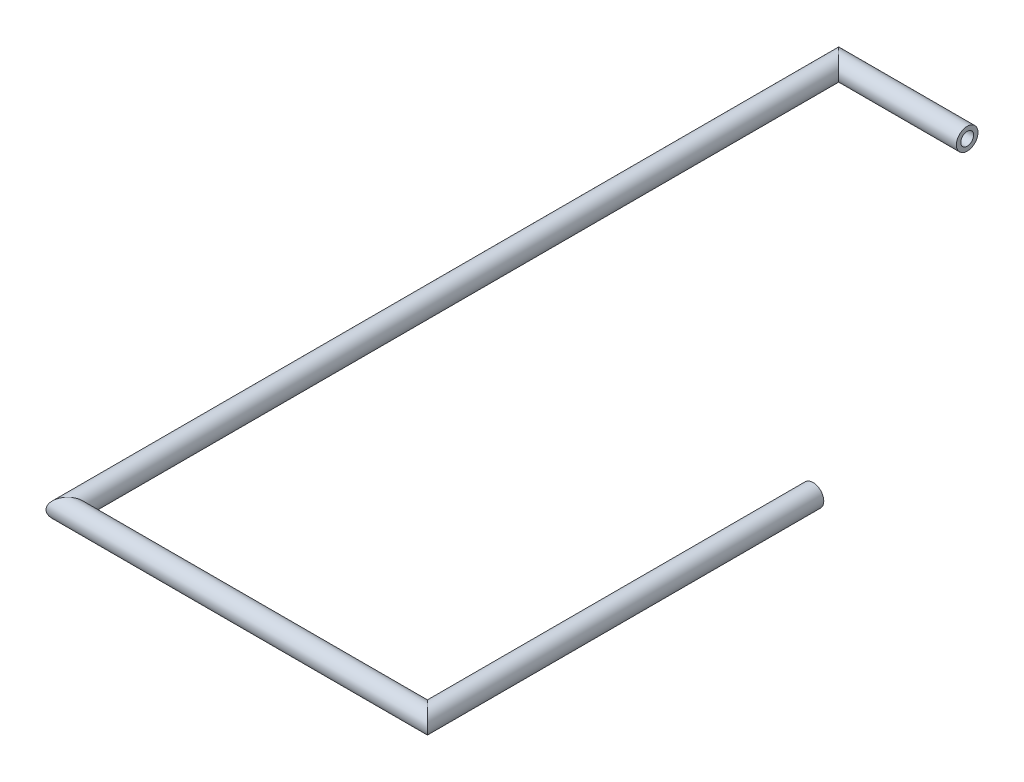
ISO-10303-21;
HEADER;
FILE_DESCRIPTION(('STEP AP214'),'2;1');
FILE_NAME('part.step','',(''),(''),'','','');
FILE_SCHEMA(('AUTOMOTIVE_DESIGN { 1 0 10303 214 1 1 1 1 }'));
ENDSEC;
DATA;
#1=APPLICATION_CONTEXT('core data for automotive mechanical design processes');
#2=APPLICATION_PROTOCOL_DEFINITION('international standard','automotive_design',2000,#1);
#3=PRODUCT_CONTEXT('',#1,'mechanical');
#4=PRODUCT('Part','Part','',(#3));
#5=PRODUCT_RELATED_PRODUCT_CATEGORY('part','',(#4));
#6=PRODUCT_DEFINITION_FORMATION('','',#4);
#7=PRODUCT_DEFINITION_CONTEXT('part definition',#1,'design');
#8=PRODUCT_DEFINITION('design','',#6,#7);
#9=PRODUCT_DEFINITION_SHAPE('','',#8);
#10=(LENGTH_UNIT() NAMED_UNIT(*) SI_UNIT(.MILLI.,.METRE.));
#11=(NAMED_UNIT(*) PLANE_ANGLE_UNIT() SI_UNIT($,.RADIAN.));
#12=(NAMED_UNIT(*) SI_UNIT($,.STERADIAN.) SOLID_ANGLE_UNIT());
#13=UNCERTAINTY_MEASURE_WITH_UNIT(LENGTH_MEASURE(1.E-05),#10,'distance_accuracy_value','');
#14=(GEOMETRIC_REPRESENTATION_CONTEXT(3) GLOBAL_UNCERTAINTY_ASSIGNED_CONTEXT((#13)) GLOBAL_UNIT_ASSIGNED_CONTEXT((#10,
#11,#12)) REPRESENTATION_CONTEXT('',''));
#15=CARTESIAN_POINT('',(0.,0.,0.));
#16=DIRECTION('',(0.,0.,1.));
#17=DIRECTION('',(1.,0.,0.));
#18=AXIS2_PLACEMENT_3D('',#15,#16,#17);
#19=CARTESIAN_POINT('',(-367.434800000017,2165.86504312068,-381.00000000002));
#20=DIRECTION('',(1.,0.,0.));
#21=DIRECTION('',(0.,1.,0.));
#22=AXIS2_PLACEMENT_3D('',#19,#20,#21);
#23=CYLINDRICAL_SURFACE('',#22,10.668);
#24=CARTESIAN_POINT('',(-355.600000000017,2165.86504312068,-381.000000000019));
#25=DIRECTION('',(0.707106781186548,0.,-0.707106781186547));
#26=DIRECTION('',(-0.707106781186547,0.,-0.707106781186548));
#27=AXIS2_PLACEMENT_3D('',#24,#25,#26);
#28=ELLIPSE('',#27,15.0868302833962,10.668);
#29=CARTESIAN_POINT('',(-366.268000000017,2165.86504312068,-391.66800000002));
#30=VERTEX_POINT('',#29);
#31=EDGE_CURVE('E34',#30,#30,#28,.F.);
#32=ORIENTED_EDGE('',*,*,#31,.F.);
#33=EDGE_LOOP('',(#32));
#34=FACE_BOUND('',#33,.T.);
#35=CARTESIAN_POINT('',(-228.60000000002,2165.86504312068,-381.00000000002));
#36=DIRECTION('',(1.,0.,0.));
#37=DIRECTION('',(0.,0.,-1.));
#38=AXIS2_PLACEMENT_3D('',#35,#36,#37);
#39=CIRCLE('',#38,10.668);
#40=CARTESIAN_POINT('',(-228.60000000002,2165.86504312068,-391.66800000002));
#41=VERTEX_POINT('',#40);
#42=EDGE_CURVE('E57',#41,#41,#39,.T.);
#43=ORIENTED_EDGE('',*,*,#42,.F.);
#44=EDGE_LOOP('',(#43));
#45=FACE_BOUND('',#44,.T.);
#46=ADVANCED_FACE('F31',(#34,#45),#23,.T.);
#47=CARTESIAN_POINT('',(-355.600000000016,2165.86504312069,392.834799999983));
#48=DIRECTION('',(0.,0.,-1.));
#49=DIRECTION('',(0.,1.,0.));
#50=AXIS2_PLACEMENT_3D('',#47,#48,#49);
#51=CYLINDRICAL_SURFACE('',#50,10.668);
#52=CARTESIAN_POINT('',(-355.600000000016,2165.86504312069,380.999999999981));
#53=DIRECTION('',(-0.707106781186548,0.,-0.707106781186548));
#54=DIRECTION('',(-0.707106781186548,0.,0.707106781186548));
#55=AXIS2_PLACEMENT_3D('',#52,#53,#54);
#56=ELLIPSE('',#55,15.0868302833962,10.668);
#57=CARTESIAN_POINT('',(-366.268000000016,2165.86504312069,391.667999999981));
#58=VERTEX_POINT('',#57);
#59=EDGE_CURVE('E62',#58,#58,#56,.F.);
#60=ORIENTED_EDGE('',*,*,#59,.F.);
#61=EDGE_LOOP('',(#60));
#62=FACE_BOUND('',#61,.T.);
#63=ORIENTED_EDGE('',*,*,#31,.T.);
#64=EDGE_LOOP('',(#63));
#65=FACE_BOUND('',#64,.T.);
#66=ADVANCED_FACE('F69',(#62,#65),#51,.T.);
#67=CARTESIAN_POINT('',(11.8347999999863,2165.86504312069,380.999999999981));
#68=DIRECTION('',(-1.,0.,0.));
#69=DIRECTION('',(0.,-1.,0.));
#70=AXIS2_PLACEMENT_3D('',#67,#68,#69);
#71=CYLINDRICAL_SURFACE('',#70,10.668);
#72=CARTESIAN_POINT('',(-1.6153745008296E-11,2165.86504312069,380.999999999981));
#73=DIRECTION('',(-0.707106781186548,0.,0.707106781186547));
#74=DIRECTION('',(0.707106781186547,0.,0.707106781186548));
#75=AXIS2_PLACEMENT_3D('',#72,#73,#74);
#76=ELLIPSE('',#75,15.0868302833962,10.668);
#77=CARTESIAN_POINT('',(10.6679999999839,2165.86504312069,391.667999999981));
#78=VERTEX_POINT('',#77);
#79=EDGE_CURVE('E60',#78,#78,#76,.F.);
#80=ORIENTED_EDGE('',*,*,#79,.F.);
#81=EDGE_LOOP('',(#80));
#82=FACE_BOUND('',#81,.T.);
#83=ORIENTED_EDGE('',*,*,#59,.T.);
#84=EDGE_LOOP('',(#83));
#85=FACE_BOUND('',#84,.T.);
#86=ADVANCED_FACE('F88',(#82,#85),#71,.T.);
#87=CARTESIAN_POINT('',(-1.6153745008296E-11,2165.86504312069,0.));
#88=DIRECTION('',(0.,0.,1.));
#89=DIRECTION('',(0.,-1.,0.));
#90=AXIS2_PLACEMENT_3D('',#87,#88,#89);
#91=CYLINDRICAL_SURFACE('',#90,10.668);
#92=CARTESIAN_POINT('',(-1.6153745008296E-11,2165.86504312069,0.));
#93=DIRECTION('',(0.,0.,1.));
#94=DIRECTION('',(1.,0.,0.));
#95=AXIS2_PLACEMENT_3D('',#92,#93,#94);
#96=CIRCLE('',#95,10.668);
#97=CARTESIAN_POINT('',(10.6679999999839,2165.86504312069,0.));
#98=VERTEX_POINT('',#97);
#99=EDGE_CURVE('E54',#98,#98,#96,.T.);
#100=ORIENTED_EDGE('',*,*,#99,.T.);
#101=EDGE_LOOP('',(#100));
#102=FACE_BOUND('',#101,.T.);
#103=ORIENTED_EDGE('',*,*,#79,.T.);
#104=EDGE_LOOP('',(#103));
#105=FACE_BOUND('',#104,.T.);
#106=ADVANCED_FACE('F78',(#102,#105),#91,.T.);
#107=CARTESIAN_POINT('',(-228.60000000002,2165.86504312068,-381.00000000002));
#108=DIRECTION('',(1.,0.,0.));
#109=DIRECTION('',(0.,0.,-1.));
#110=AXIS2_PLACEMENT_3D('',#107,#108,#109);
#111=PLANE('',#110);
#112=CARTESIAN_POINT('',(-228.60000000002,2165.86504312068,-381.00000000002));
#113=DIRECTION('',(1.,0.,0.));
#114=DIRECTION('',(0.,0.,-1.));
#115=AXIS2_PLACEMENT_3D('',#112,#113,#114);
#116=CIRCLE('',#115,6.35000000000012);
#117=CARTESIAN_POINT('',(-228.60000000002,2165.86504312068,-387.35000000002));
#118=VERTEX_POINT('',#117);
#119=EDGE_CURVE('E51',#118,#118,#116,.F.);
#120=ORIENTED_EDGE('',*,*,#119,.T.);
#121=EDGE_LOOP('',(#120));
#122=FACE_BOUND('',#121,.T.);
#123=ORIENTED_EDGE('',*,*,#42,.T.);
#124=EDGE_LOOP('',(#123));
#125=FACE_BOUND('',#124,.T.);
#126=ADVANCED_FACE('F75',(#122,#125),#111,.T.);
#127=CARTESIAN_POINT('',(-1.6153745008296E-11,2165.86504312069,0.));
#128=DIRECTION('',(0.,0.,1.));
#129=DIRECTION('',(1.,0.,0.));
#130=AXIS2_PLACEMENT_3D('',#127,#128,#129);
#131=PLANE('',#130);
#132=CARTESIAN_POINT('',(-1.6153745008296E-11,2165.86504312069,0.));
#133=DIRECTION('',(0.,0.,1.));
#134=DIRECTION('',(1.,0.,0.));
#135=AXIS2_PLACEMENT_3D('',#132,#133,#134);
#136=CIRCLE('',#135,6.35000000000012);
#137=CARTESIAN_POINT('',(6.34999999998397,2165.86504312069,0.));
#138=VERTEX_POINT('',#137);
#139=EDGE_CURVE('E38',#138,#138,#136,.F.);
#140=ORIENTED_EDGE('',*,*,#139,.F.);
#141=EDGE_LOOP('',(#140));
#142=FACE_BOUND('',#141,.T.);
#143=ORIENTED_EDGE('',*,*,#99,.F.);
#144=EDGE_LOOP('',(#143));
#145=FACE_BOUND('',#144,.T.);
#146=ADVANCED_FACE('F77',(#142,#145),#131,.F.);
#147=CARTESIAN_POINT('',(-362.685000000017,2165.86504312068,-381.00000000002));
#148=DIRECTION('',(1.,0.,0.));
#149=DIRECTION('',(0.,1.,0.));
#150=AXIS2_PLACEMENT_3D('',#147,#148,#149);
#151=CYLINDRICAL_SURFACE('',#150,6.35000000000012);
#152=CARTESIAN_POINT('',(-355.600000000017,2165.86504312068,-381.000000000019));
#153=DIRECTION('',(0.707106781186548,0.,-0.707106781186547));
#154=DIRECTION('',(-0.707106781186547,0.,-0.707106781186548));
#155=AXIS2_PLACEMENT_3D('',#152,#153,#154);
#156=ELLIPSE('',#155,8.98025612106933,6.35000000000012);
#157=CARTESIAN_POINT('',(-361.950000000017,2165.86504312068,-387.35000000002));
#158=VERTEX_POINT('',#157);
#159=EDGE_CURVE('E48',#158,#158,#156,.T.);
#160=ORIENTED_EDGE('',*,*,#159,.F.);
#161=EDGE_LOOP('',(#160));
#162=FACE_BOUND('',#161,.T.);
#163=ORIENTED_EDGE('',*,*,#119,.F.);
#164=EDGE_LOOP('',(#163));
#165=FACE_BOUND('',#164,.T.);
#166=ADVANCED_FACE('F85',(#162,#165),#151,.F.);
#167=CARTESIAN_POINT('',(-355.600000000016,2165.86504312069,388.084999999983));
#168=DIRECTION('',(0.,0.,-1.));
#169=DIRECTION('',(0.,1.,0.));
#170=AXIS2_PLACEMENT_3D('',#167,#168,#169);
#171=CYLINDRICAL_SURFACE('',#170,6.35000000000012);
#172=CARTESIAN_POINT('',(-355.600000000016,2165.86504312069,380.999999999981));
#173=DIRECTION('',(-0.707106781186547,0.,-0.707106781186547));
#174=DIRECTION('',(-0.707106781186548,0.,0.707106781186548));
#175=AXIS2_PLACEMENT_3D('',#172,#173,#174);
#176=ELLIPSE('',#175,8.98025612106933,6.35000000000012);
#177=CARTESIAN_POINT('',(-361.950000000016,2165.86504312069,387.349999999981));
#178=VERTEX_POINT('',#177);
#179=EDGE_CURVE('E43',#178,#178,#176,.T.);
#180=ORIENTED_EDGE('',*,*,#179,.F.);
#181=EDGE_LOOP('',(#180));
#182=FACE_BOUND('',#181,.T.);
#183=ORIENTED_EDGE('',*,*,#159,.T.);
#184=EDGE_LOOP('',(#183));
#185=FACE_BOUND('',#184,.T.);
#186=ADVANCED_FACE('F99',(#182,#185),#171,.F.);
#187=CARTESIAN_POINT('',(7.08499999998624,2165.86504312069,380.999999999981));
#188=DIRECTION('',(-1.,0.,0.));
#189=DIRECTION('',(0.,-1.,0.));
#190=AXIS2_PLACEMENT_3D('',#187,#188,#189);
#191=CYLINDRICAL_SURFACE('',#190,6.35000000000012);
#192=CARTESIAN_POINT('',(-1.6153745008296E-11,2165.86504312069,380.999999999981));
#193=DIRECTION('',(-0.707106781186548,0.,0.707106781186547));
#194=DIRECTION('',(0.707106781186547,0.,0.707106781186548));
#195=AXIS2_PLACEMENT_3D('',#192,#193,#194);
#196=ELLIPSE('',#195,8.98025612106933,6.35000000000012);
#197=CARTESIAN_POINT('',(6.34999999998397,2165.86504312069,387.349999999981));
#198=VERTEX_POINT('',#197);
#199=EDGE_CURVE('E10',#198,#198,#196,.T.);
#200=ORIENTED_EDGE('',*,*,#199,.F.);
#201=EDGE_LOOP('',(#200));
#202=FACE_BOUND('',#201,.T.);
#203=ORIENTED_EDGE('',*,*,#179,.T.);
#204=EDGE_LOOP('',(#203));
#205=FACE_BOUND('',#204,.T.);
#206=ADVANCED_FACE('F93',(#202,#205),#191,.F.);
#207=CARTESIAN_POINT('',(-1.6153745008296E-11,2165.86504312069,0.));
#208=DIRECTION('',(0.,0.,1.));
#209=DIRECTION('',(0.,-1.,0.));
#210=AXIS2_PLACEMENT_3D('',#207,#208,#209);
#211=CYLINDRICAL_SURFACE('',#210,6.35000000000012);
#212=ORIENTED_EDGE('',*,*,#139,.T.);
#213=EDGE_LOOP('',(#212));
#214=FACE_BOUND('',#213,.T.);
#215=ORIENTED_EDGE('',*,*,#199,.T.);
#216=EDGE_LOOP('',(#215));
#217=FACE_BOUND('',#216,.T.);
#218=ADVANCED_FACE('F91',(#214,#217),#211,.F.);
#219=CLOSED_SHELL('',(#46,#66,#86,#106,#126,#146,#166,#186,#206,#218));
#220=MANIFOLD_SOLID_BREP('B2',#219);
#221=ADVANCED_BREP_SHAPE_REPRESENTATION('',(#18,#220),#14);
#222=SHAPE_DEFINITION_REPRESENTATION(#9,#221);
ENDSEC;
END-ISO-10303-21;
